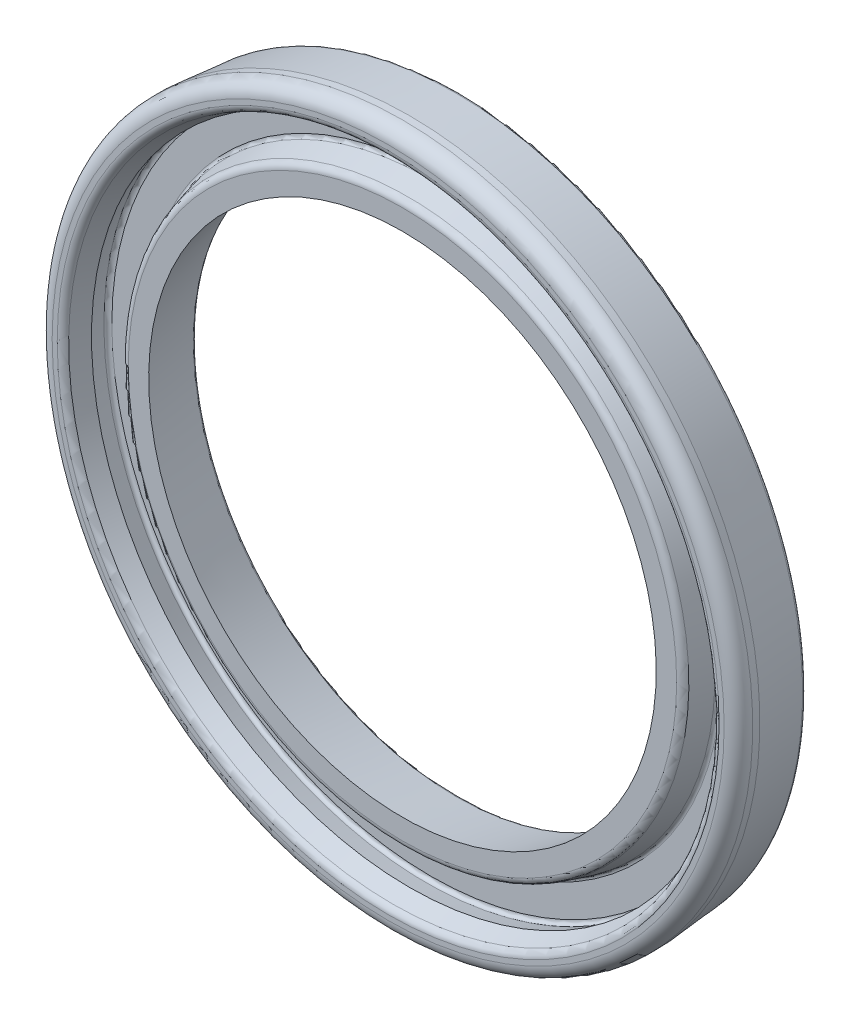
ISO-10303-21;
HEADER;
FILE_DESCRIPTION(('STEP AP214'),'2;1');
FILE_NAME('part.step','',(''),(''),'','','');
FILE_SCHEMA(('AUTOMOTIVE_DESIGN { 1 0 10303 214 1 1 1 1 }'));
ENDSEC;
DATA;
#1=APPLICATION_CONTEXT('core data for automotive mechanical design processes');
#2=APPLICATION_PROTOCOL_DEFINITION('international standard','automotive_design',2000,#1);
#3=PRODUCT_CONTEXT('',#1,'mechanical');
#4=PRODUCT('Part','Part','',(#3));
#5=PRODUCT_RELATED_PRODUCT_CATEGORY('part','',(#4));
#6=PRODUCT_DEFINITION_FORMATION('','',#4);
#7=PRODUCT_DEFINITION_CONTEXT('part definition',#1,'design');
#8=PRODUCT_DEFINITION('design','',#6,#7);
#9=PRODUCT_DEFINITION_SHAPE('','',#8);
#10=(LENGTH_UNIT() NAMED_UNIT(*) SI_UNIT(.MILLI.,.METRE.));
#11=(NAMED_UNIT(*) PLANE_ANGLE_UNIT() SI_UNIT($,.RADIAN.));
#12=(NAMED_UNIT(*) SI_UNIT($,.STERADIAN.) SOLID_ANGLE_UNIT());
#13=UNCERTAINTY_MEASURE_WITH_UNIT(LENGTH_MEASURE(1.E-05),#10,'distance_accuracy_value','');
#14=(GEOMETRIC_REPRESENTATION_CONTEXT(3) GLOBAL_UNCERTAINTY_ASSIGNED_CONTEXT((#13)) GLOBAL_UNIT_ASSIGNED_CONTEXT((#10,
#11,#12)) REPRESENTATION_CONTEXT('',''));
#15=CARTESIAN_POINT('',(0.,0.,0.));
#16=DIRECTION('',(0.,0.,1.));
#17=DIRECTION('',(1.,0.,0.));
#18=AXIS2_PLACEMENT_3D('',#15,#16,#17);
#19=CARTESIAN_POINT('',(0.,0.,4.62940949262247));
#20=DIRECTION('',(0.,0.,-1.));
#21=DIRECTION('',(0.,1.,0.));
#22=AXIS2_PLACEMENT_3D('',#19,#20,#21);
#23=CONICAL_SURFACE('',#22,45.1351977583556,0.261799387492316);
#24=CARTESIAN_POINT('',(0.,0.,4.62940949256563));
#25=DIRECTION('',(0.,0.,-1.));
#26=DIRECTION('',(1.38839100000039E-13,1.,0.));
#27=AXIS2_PLACEMENT_3D('',#24,#25,#26);
#28=CIRCLE('',#27,45.135197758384);
#29=CARTESIAN_POINT('',(6.2665302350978E-12,45.135197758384,4.62940949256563));
#30=VERTEX_POINT('',#29);
#31=EDGE_CURVE('E623',#30,#30,#28,.F.);
#32=ORIENTED_EDGE('',*,*,#31,.F.);
#33=EDGE_LOOP('',(#32));
#34=FACE_BOUND('',#33,.T.);
#35=CARTESIAN_POINT('',(0.,0.,7.00000001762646));
#36=DIRECTION('',(0.,0.,1.));
#37=DIRECTION('',(-7.29255799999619E-13,1.,0.));
#38=AXIS2_PLACEMENT_3D('',#35,#36,#37);
#39=CIRCLE('',#38,44.499999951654);
#40=CARTESIAN_POINT('',(-3.24518830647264E-11,44.499999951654,7.00000001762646));
#41=VERTEX_POINT('',#40);
#42=EDGE_CURVE('E128',#41,#41,#39,.T.);
#43=ORIENTED_EDGE('',*,*,#42,.T.);
#44=EDGE_LOOP('',(#43));
#45=FACE_BOUND('',#44,.T.);
#46=ADVANCED_FACE('F16',(#34,#45),#23,.F.);
#47=CARTESIAN_POINT('',(0.,0.,4.5));
#48=DIRECTION('',(0.,0.,1.));
#49=DIRECTION('',(1.973977E-13,-1.,0.));
#50=AXIS2_PLACEMENT_3D('',#47,#48,#49);
#51=TOROIDAL_SURFACE('',#50,44.65223489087,0.5);
#52=ORIENTED_EDGE('',*,*,#31,.T.);
#53=EDGE_LOOP('',(#52));
#54=FACE_BOUND('',#53,.T.);
#55=CARTESIAN_POINT('',(0.,0.,4.));
#56=DIRECTION('',(0.,0.,-1.));
#57=DIRECTION('',(1.,1.97558512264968E-13,0.));
#58=AXIS2_PLACEMENT_3D('',#55,#56,#57);
#59=CIRCLE('',#58,44.652234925);
#60=CARTESIAN_POINT('',(8.81073163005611E-12,-44.652234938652,4.00000000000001));
#61=VERTEX_POINT('',#60);
#62=CARTESIAN_POINT('',(44.652234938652,-3.92206797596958E-11,4.));
#63=VERTEX_POINT('',#62);
#64=EDGE_CURVE('E115',#61,#63,#59,.F.);
#65=ORIENTED_EDGE('',*,*,#64,.F.);
#66=CARTESIAN_POINT('',(0.,0.,4.));
#67=DIRECTION('',(0.,0.,-1.));
#68=DIRECTION('',(1.97152770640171E-13,-1.,0.));
#69=AXIS2_PLACEMENT_3D('',#66,#67,#68);
#70=CIRCLE('',#69,44.652234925);
#71=CARTESIAN_POINT('',(-44.652234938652,1.52175718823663E-11,4.));
#72=VERTEX_POINT('',#71);
#73=EDGE_CURVE('E118',#72,#61,#70,.F.);
#74=ORIENTED_EDGE('',*,*,#73,.F.);
#75=CARTESIAN_POINT('',(0.,0.,4.));
#76=DIRECTION('',(0.,0.,-1.));
#77=DIRECTION('',(-1.,-1.97214002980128E-13,0.));
#78=AXIS2_PLACEMENT_3D('',#75,#76,#77);
#79=CIRCLE('',#78,44.652234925);
#80=CARTESIAN_POINT('',(-8.80745063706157E-12,44.652234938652,4.));
#81=VERTEX_POINT('',#80);
#82=EDGE_CURVE('E126',#81,#72,#79,.F.);
#83=ORIENTED_EDGE('',*,*,#82,.F.);
#84=CARTESIAN_POINT('',(0.,0.,4.));
#85=DIRECTION('',(0.,0.,-1.));
#86=DIRECTION('',(-1.97275235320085E-13,1.,0.));
#87=AXIS2_PLACEMENT_3D('',#84,#85,#86);
#88=CIRCLE('',#87,44.652234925);
#89=EDGE_CURVE('E112',#63,#81,#88,.F.);
#90=ORIENTED_EDGE('',*,*,#89,.F.);
#91=EDGE_LOOP('',(#65,#74,#83,#90));
#92=FACE_BOUND('',#91,.T.);
#93=ADVANCED_FACE('F117',(#54,#92),#51,.F.);
#94=CARTESIAN_POINT('',(0.,0.,9.34202016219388));
#95=DIRECTION('',(0.,0.,1.));
#96=DIRECTION('',(0.,-1.,0.));
#97=AXIS2_PLACEMENT_3D('',#94,#95,#96);
#98=CONICAL_SURFACE('',#97,45.3524255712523,0.349065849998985);
#99=ORIENTED_EDGE('',*,*,#42,.F.);
#100=EDGE_LOOP('',(#99));
#101=FACE_BOUND('',#100,.T.);
#102=CARTESIAN_POINT('',(0.,0.,9.34202014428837));
#103=DIRECTION('',(0.,0.,1.));
#104=DIRECTION('',(1.973977E-13,-1.,0.));
#105=AXIS2_PLACEMENT_3D('',#102,#103,#104);
#106=CIRCLE('',#105,45.3524256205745);
#107=CARTESIAN_POINT('',(8.95246450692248E-12,-45.3524256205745,9.34202014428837));
#108=VERTEX_POINT('',#107);
#109=EDGE_CURVE('E206',#108,#108,#106,.F.);
#110=ORIENTED_EDGE('',*,*,#109,.F.);
#111=EDGE_LOOP('',(#110));
#112=FACE_BOUND('',#111,.T.);
#113=ADVANCED_FACE('F148',(#101,#112),#98,.F.);
#114=CARTESIAN_POINT('',(49.1174584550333,49.1174584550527,4.));
#115=DIRECTION('',(0.,0.,1.));
#116=DIRECTION('',(0.,-1.,0.));
#117=AXIS2_PLACEMENT_3D('',#114,#115,#116);
#118=PLANE('',#117);
#119=CARTESIAN_POINT('',(0.,0.,4.));
#120=DIRECTION('',(0.,0.,1.));
#121=DIRECTION('',(-1.,-1.97214002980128E-13,0.));
#122=AXIS2_PLACEMENT_3D('',#119,#120,#121);
#123=CIRCLE('',#122,40.58366348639);
#124=CARTESIAN_POINT('',(8.00966652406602E-12,-40.58366348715,4.));
#125=VERTEX_POINT('',#124);
#126=CARTESIAN_POINT('',(-40.58366348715,-8.00535096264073E-12,4.));
#127=VERTEX_POINT('',#126);
#128=EDGE_CURVE('E694',#125,#127,#123,.F.);
#129=ORIENTED_EDGE('',*,*,#128,.T.);
#130=CARTESIAN_POINT('',(0.,0.,4.));
#131=DIRECTION('',(0.,0.,1.));
#132=DIRECTION('',(-1.97275235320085E-13,1.,0.));
#133=AXIS2_PLACEMENT_3D('',#130,#131,#132);
#134=CIRCLE('',#133,40.58366348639);
#135=CARTESIAN_POINT('',(-8.00668448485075E-12,40.58366348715,4.));
#136=VERTEX_POINT('',#135);
#137=EDGE_CURVE('E189',#127,#136,#134,.F.);
#138=ORIENTED_EDGE('',*,*,#137,.T.);
#139=CARTESIAN_POINT('',(0.,0.,4.));
#140=DIRECTION('',(0.,0.,1.));
#141=DIRECTION('',(1.,1.97336467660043E-13,0.));
#142=AXIS2_PLACEMENT_3D('',#139,#140,#141);
#143=CIRCLE('',#142,40.58366348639);
#144=CARTESIAN_POINT('',(40.58366348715,8.00921850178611E-12,4.));
#145=VERTEX_POINT('',#144);
#146=EDGE_CURVE('E202',#136,#145,#143,.F.);
#147=ORIENTED_EDGE('',*,*,#146,.T.);
#148=CARTESIAN_POINT('',(0.,0.,4.));
#149=DIRECTION('',(0.,0.,1.));
#150=DIRECTION('',(1.973977E-13,-1.,0.));
#151=AXIS2_PLACEMENT_3D('',#148,#149,#150);
#152=CIRCLE('',#151,40.58366348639);
#153=EDGE_CURVE('E704',#145,#125,#152,.F.);
#154=ORIENTED_EDGE('',*,*,#153,.T.);
#155=EDGE_LOOP('',(#129,#138,#147,#154));
#156=FACE_BOUND('',#155,.T.);
#157=ORIENTED_EDGE('',*,*,#89,.T.);
#158=ORIENTED_EDGE('',*,*,#82,.T.);
#159=ORIENTED_EDGE('',*,*,#73,.T.);
#160=ORIENTED_EDGE('',*,*,#64,.T.);
#161=EDGE_LOOP('',(#157,#158,#159,#160));
#162=FACE_BOUND('',#161,.T.);
#163=ADVANCED_FACE('F125',(#156,#162),#118,.T.);
#164=CARTESIAN_POINT('',(0.,0.,9.));
#165=DIRECTION('',(0.,0.,1.));
#166=DIRECTION('',(1.973977E-13,-1.,0.));
#167=AXIS2_PLACEMENT_3D('',#164,#165,#166);
#168=TOROIDAL_SURFACE('',#167,46.29211824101,1.);
#169=CARTESIAN_POINT('',(0.,0.,10.));
#170=DIRECTION('',(0.,0.,1.));
#171=DIRECTION('',(1.,1.97558512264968E-13,0.));
#172=AXIS2_PLACEMENT_3D('',#169,#170,#171);
#173=CIRCLE('',#172,46.292118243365);
#174=CARTESIAN_POINT('',(46.292118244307,9.14812191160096E-12,10.));
#175=VERTEX_POINT('',#174);
#176=CARTESIAN_POINT('',(-9.13200686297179E-12,46.292118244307,10.));
#177=VERTEX_POINT('',#176);
#178=EDGE_CURVE('E240',#175,#177,#173,.T.);
#179=ORIENTED_EDGE('',*,*,#178,.T.);
#180=CARTESIAN_POINT('',(0.,0.,10.));
#181=DIRECTION('',(0.,0.,1.));
#182=DIRECTION('',(-1.97275235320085E-13,1.,0.));
#183=AXIS2_PLACEMENT_3D('',#180,#181,#182);
#184=CIRCLE('',#183,46.292118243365);
#185=CARTESIAN_POINT('',(-46.292118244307,-9.13358514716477E-12,10.));
#186=VERTEX_POINT('',#185);
#187=EDGE_CURVE('E250',#177,#186,#184,.T.);
#188=ORIENTED_EDGE('',*,*,#187,.T.);
#189=CARTESIAN_POINT('',(0.,0.,10.));
#190=DIRECTION('',(0.,0.,1.));
#191=DIRECTION('',(-1.,-1.97214002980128E-13,0.));
#192=AXIS2_PLACEMENT_3D('',#189,#190,#191);
#193=CIRCLE('',#192,46.292118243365);
#194=CARTESIAN_POINT('',(9.13540835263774E-12,-46.292118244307,10.));
#195=VERTEX_POINT('',#194);
#196=EDGE_CURVE('E244',#186,#195,#193,.T.);
#197=ORIENTED_EDGE('',*,*,#196,.T.);
#198=CARTESIAN_POINT('',(0.,0.,10.));
#199=DIRECTION('',(0.,0.,1.));
#200=DIRECTION('',(1.973977E-13,-1.,0.));
#201=AXIS2_PLACEMENT_3D('',#198,#199,#200);
#202=CIRCLE('',#201,46.292118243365);
#203=EDGE_CURVE('E234',#195,#175,#202,.T.);
#204=ORIENTED_EDGE('',*,*,#203,.T.);
#205=EDGE_LOOP('',(#179,#188,#197,#204));
#206=FACE_BOUND('',#205,.T.);
#207=ORIENTED_EDGE('',*,*,#109,.T.);
#208=EDGE_LOOP('',(#207));
#209=FACE_BOUND('',#208,.T.);
#210=ADVANCED_FACE('F147',(#206,#209),#168,.T.);
#211=CARTESIAN_POINT('',(0.,0.,4.5));
#212=DIRECTION('',(0.,0.,1.));
#213=DIRECTION('',(1.973977E-13,-1.,0.));
#214=AXIS2_PLACEMENT_3D('',#211,#212,#213);
#215=TOROIDAL_SURFACE('',#214,40.58366349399,0.5);
#216=CARTESIAN_POINT('',(0.,0.,4.37059046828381));
#217=DIRECTION('',(0.,0.,-1.));
#218=DIRECTION('',(1.97397699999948E-13,-1.,0.));
#219=AXIS2_PLACEMENT_3D('',#216,#217,#218);
#220=CIRCLE('',#219,40.1007005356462);
#221=CARTESIAN_POINT('',(7.91578605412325E-12,-40.1007005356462,4.37059046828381));
#222=VERTEX_POINT('',#221);
#223=EDGE_CURVE('E231',#222,#222,#220,.F.);
#224=ORIENTED_EDGE('',*,*,#223,.F.);
#225=EDGE_LOOP('',(#224));
#226=FACE_BOUND('',#225,.T.);
#227=ORIENTED_EDGE('',*,*,#137,.F.);
#228=ORIENTED_EDGE('',*,*,#128,.F.);
#229=ORIENTED_EDGE('',*,*,#153,.F.);
#230=ORIENTED_EDGE('',*,*,#146,.F.);
#231=EDGE_LOOP('',(#227,#228,#229,#230));
#232=FACE_BOUND('',#231,.T.);
#233=ADVANCED_FACE('F208',(#226,#232),#215,.F.);
#234=CARTESIAN_POINT('',(-51.6999994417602,51.6999994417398,10.));
#235=DIRECTION('',(0.,0.,-1.));
#236=DIRECTION('',(0.,1.,0.));
#237=AXIS2_PLACEMENT_3D('',#234,#235,#236);
#238=PLANE('',#237);
#239=ORIENTED_EDGE('',*,*,#196,.F.);
#240=ORIENTED_EDGE('',*,*,#187,.F.);
#241=ORIENTED_EDGE('',*,*,#178,.F.);
#242=ORIENTED_EDGE('',*,*,#203,.F.);
#243=EDGE_LOOP('',(#239,#240,#241,#242));
#244=FACE_BOUND('',#243,.T.);
#245=CARTESIAN_POINT('',(0.,0.,9.99999999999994));
#246=DIRECTION('',(0.,0.,-1.));
#247=DIRECTION('',(-1.,-1.97581397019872E-13,0.));
#248=AXIS2_PLACEMENT_3D('',#245,#246,#247);
#249=CIRCLE('',#248,46.9999994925);
#250=CARTESIAN_POINT('',(-46.99999954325,-9.27913984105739E-12,9.99999999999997));
#251=VERTEX_POINT('',#250);
#252=CARTESIAN_POINT('',(-9.28031110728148E-12,46.99999954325,9.99999999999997));
#253=VERTEX_POINT('',#252);
#254=EDGE_CURVE('E233',#251,#253,#249,.T.);
#255=ORIENTED_EDGE('',*,*,#254,.F.);
#256=CARTESIAN_POINT('',(0.,0.,9.99999999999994));
#257=DIRECTION('',(0.,0.,-1.));
#258=DIRECTION('',(1.97520164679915E-13,-1.,0.));
#259=AXIS2_PLACEMENT_3D('',#256,#257,#258);
#260=CIRCLE('',#259,46.9999994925);
#261=CARTESIAN_POINT('',(9.283764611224E-12,-46.99999954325,9.99999999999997));
#262=VERTEX_POINT('',#261);
#263=EDGE_CURVE('E292',#262,#251,#260,.T.);
#264=ORIENTED_EDGE('',*,*,#263,.F.);
#265=CARTESIAN_POINT('',(0.,0.,9.99999999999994));
#266=DIRECTION('',(0.,0.,-1.));
#267=DIRECTION('',(1.,1.97014843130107E-13,0.));
#268=AXIS2_PLACEMENT_3D('',#265,#266,#267);
#269=CIRCLE('',#268,46.9999994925);
#270=CARTESIAN_POINT('',(46.99999954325,9.26018136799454E-12,9.99999999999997));
#271=VERTEX_POINT('',#270);
#272=EDGE_CURVE('E298',#271,#262,#269,.T.);
#273=ORIENTED_EDGE('',*,*,#272,.F.);
#274=CARTESIAN_POINT('',(0.,0.,9.99999999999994));
#275=DIRECTION('',(0.,0.,-1.));
#276=DIRECTION('',(-1.973977E-13,1.,0.));
#277=AXIS2_PLACEMENT_3D('',#274,#275,#276);
#278=CIRCLE('',#277,46.9999994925);
#279=EDGE_CURVE('E305',#253,#271,#278,.T.);
#280=ORIENTED_EDGE('',*,*,#279,.F.);
#281=EDGE_LOOP('',(#255,#264,#273,#280));
#282=FACE_BOUND('',#281,.T.);
#283=ADVANCED_FACE('F218',(#244,#282),#238,.F.);
#284=CARTESIAN_POINT('',(0.,0.,4.37059046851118));
#285=DIRECTION('',(0.,0.,-1.));
#286=DIRECTION('',(0.,1.,0.));
#287=AXIS2_PLACEMENT_3D('',#284,#285,#286);
#288=CONICAL_SURFACE('',#287,40.1007005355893,0.26179938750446);
#289=ORIENTED_EDGE('',*,*,#223,.T.);
#290=EDGE_LOOP('',(#289));
#291=FACE_BOUND('',#290,.T.);
#292=CARTESIAN_POINT('',(0.,0.,7.25881916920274));
#293=DIRECTION('',(0.,0.,1.));
#294=DIRECTION('',(1.973977E-13,-1.,0.));
#295=AXIS2_PLACEMENT_3D('',#292,#293,#294);
#296=CIRCLE('',#295,39.3268020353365);
#297=CARTESIAN_POINT('',(7.76302027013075E-12,-39.3268020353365,7.25881916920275));
#298=VERTEX_POINT('',#297);
#299=EDGE_CURVE('E301',#298,#298,#296,.T.);
#300=ORIENTED_EDGE('',*,*,#299,.F.);
#301=EDGE_LOOP('',(#300));
#302=FACE_BOUND('',#301,.T.);
#303=ADVANCED_FACE('F348',(#291,#302),#288,.T.);
#304=CARTESIAN_POINT('',(0.,0.,8.));
#305=DIRECTION('',(0.,0.,-1.));
#306=DIRECTION('',(-1.973977E-13,1.,0.));
#307=AXIS2_PLACEMENT_3D('',#304,#305,#306);
#308=TOROIDAL_SURFACE('',#307,47.,2.);
#309=ORIENTED_EDGE('',*,*,#254,.T.);
#310=ORIENTED_EDGE('',*,*,#279,.T.);
#311=ORIENTED_EDGE('',*,*,#272,.T.);
#312=ORIENTED_EDGE('',*,*,#263,.T.);
#313=EDGE_LOOP('',(#309,#310,#311,#312));
#314=FACE_BOUND('',#313,.T.);
#315=CARTESIAN_POINT('',(0.,0.,8.));
#316=DIRECTION('',(0.,0.,1.));
#317=DIRECTION('',(0.,-1.,0.));
#318=AXIS2_PLACEMENT_3D('',#315,#316,#317);
#319=CIRCLE('',#318,49.);
#320=CARTESIAN_POINT('',(0.,-49.,8.));
#321=VERTEX_POINT('',#320);
#322=EDGE_CURVE('E303',#321,#321,#319,.F.);
#323=ORIENTED_EDGE('',*,*,#322,.F.);
#324=EDGE_LOOP('',(#323));
#325=FACE_BOUND('',#324,.T.);
#326=ADVANCED_FACE('F293',(#314,#325),#308,.T.);
#327=CARTESIAN_POINT('',(0.,0.,7.));
#328=DIRECTION('',(0.,0.,1.));
#329=DIRECTION('',(1.973977E-13,-1.,0.));
#330=AXIS2_PLACEMENT_3D('',#327,#328,#329);
#331=TOROIDAL_SURFACE('',#330,38.3608762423,1.);
#332=ORIENTED_EDGE('',*,*,#299,.T.);
#333=EDGE_LOOP('',(#332));
#334=FACE_BOUND('',#333,.T.);
#335=CARTESIAN_POINT('',(0.,0.,7.99999999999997));
#336=DIRECTION('',(0.,0.,-1.));
#337=DIRECTION('',(-1.97275235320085E-13,1.,0.));
#338=AXIS2_PLACEMENT_3D('',#335,#336,#337);
#339=CIRCLE('',#338,38.360876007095);
#340=CARTESIAN_POINT('',(38.360875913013,7.56839514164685E-12,7.99999999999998));
#341=VERTEX_POINT('',#340);
#342=CARTESIAN_POINT('',(-7.56872380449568E-12,38.360875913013,7.99999999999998));
#343=VERTEX_POINT('',#342);
#344=EDGE_CURVE('E490',#341,#343,#339,.F.);
#345=ORIENTED_EDGE('',*,*,#344,.F.);
#346=CARTESIAN_POINT('',(0.,0.,7.99999999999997));
#347=DIRECTION('',(0.,0.,-1.));
#348=DIRECTION('',(1.,1.97336467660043E-13,0.));
#349=AXIS2_PLACEMENT_3D('',#346,#347,#348);
#350=CIRCLE('',#349,38.360876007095);
#351=CARTESIAN_POINT('',(7.57154251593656E-12,-38.360875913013,7.99999999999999));
#352=VERTEX_POINT('',#351);
#353=EDGE_CURVE('E404',#352,#341,#350,.F.);
#354=ORIENTED_EDGE('',*,*,#353,.F.);
#355=CARTESIAN_POINT('',(0.,0.,7.99999999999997));
#356=DIRECTION('',(0.,0.,-1.));
#357=DIRECTION('',(1.97152770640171E-13,-1.,0.));
#358=AXIS2_PLACEMENT_3D('',#355,#356,#357);
#359=CIRCLE('',#358,38.360876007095);
#360=CARTESIAN_POINT('',(-38.360875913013,-7.57281074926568E-12,7.99999999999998));
#361=VERTEX_POINT('',#360);
#362=EDGE_CURVE('E382',#361,#352,#359,.F.);
#363=ORIENTED_EDGE('',*,*,#362,.F.);
#364=CARTESIAN_POINT('',(0.,0.,7.99999999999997));
#365=DIRECTION('',(0.,0.,-1.));
#366=DIRECTION('',(-1.,-1.97214002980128E-13,0.));
#367=AXIS2_PLACEMENT_3D('',#364,#365,#366);
#368=CIRCLE('',#367,38.360876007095);
#369=EDGE_CURVE('E338',#343,#361,#368,.F.);
#370=ORIENTED_EDGE('',*,*,#369,.F.);
#371=EDGE_LOOP('',(#345,#354,#363,#370));
#372=FACE_BOUND('',#371,.T.);
#373=ADVANCED_FACE('F347',(#334,#372),#331,.T.);
#374=CARTESIAN_POINT('',(0.,0.,10.5));
#375=DIRECTION('',(0.,0.,1.));
#376=DIRECTION('',(0.,-1.,0.));
#377=AXIS2_PLACEMENT_3D('',#374,#375,#376);
#378=CYLINDRICAL_SURFACE('',#377,49.);
#379=CARTESIAN_POINT('',(0.,0.,7.00000000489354));
#380=DIRECTION('',(0.,0.,1.));
#381=DIRECTION('',(-7.17265399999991E-13,1.,0.));
#382=AXIS2_PLACEMENT_3D('',#379,#380,#381);
#383=CIRCLE('',#382,48.9999999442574);
#384=CARTESIAN_POINT('',(-3.51460045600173E-11,48.9999999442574,7.00000000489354));
#385=VERTEX_POINT('',#384);
#386=EDGE_CURVE('E494',#385,#385,#383,.F.);
#387=ORIENTED_EDGE('',*,*,#386,.F.);
#388=EDGE_LOOP('',(#387));
#389=FACE_BOUND('',#388,.T.);
#390=ORIENTED_EDGE('',*,*,#322,.T.);
#391=EDGE_LOOP('',(#390));
#392=FACE_BOUND('',#391,.T.);
#393=ADVANCED_FACE('F472',(#389,#392),#378,.T.);
#394=CARTESIAN_POINT('',(42.1969633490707,42.1969633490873,8.));
#395=DIRECTION('',(0.,0.,1.));
#396=DIRECTION('',(0.,-1.,0.));
#397=AXIS2_PLACEMENT_3D('',#394,#395,#396);
#398=PLANE('',#397);
#399=CARTESIAN_POINT('',(0.,0.,7.99999999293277));
#400=DIRECTION('',(0.,0.,-1.));
#401=DIRECTION('',(0.,1.,0.));
#402=AXIS2_PLACEMENT_3D('',#399,#400,#401);
#403=CIRCLE('',#402,35.4999999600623);
#404=CARTESIAN_POINT('',(0.,35.4999999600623,7.99999999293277));
#405=VERTEX_POINT('',#404);
#406=EDGE_CURVE('E455',#405,#405,#403,.T.);
#407=ORIENTED_EDGE('',*,*,#406,.T.);
#408=EDGE_LOOP('',(#407));
#409=FACE_BOUND('',#408,.T.);
#410=ORIENTED_EDGE('',*,*,#353,.T.);
#411=ORIENTED_EDGE('',*,*,#344,.T.);
#412=ORIENTED_EDGE('',*,*,#369,.T.);
#413=ORIENTED_EDGE('',*,*,#362,.T.);
#414=EDGE_LOOP('',(#410,#411,#412,#413));
#415=FACE_BOUND('',#414,.T.);
#416=ADVANCED_FACE('F463',(#409,#415),#398,.T.);
#417=CARTESIAN_POINT('',(0.,0.,7.0000000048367));
#418=DIRECTION('',(0.,0.,1.));
#419=DIRECTION('',(0.,-1.,0.));
#420=AXIS2_PLACEMENT_3D('',#417,#418,#419);
#421=CONICAL_SURFACE('',#420,48.9999999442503,0.0872664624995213);
#422=ORIENTED_EDGE('',*,*,#386,.T.);
#423=EDGE_LOOP('',(#422));
#424=FACE_BOUND('',#423,.T.);
#425=CARTESIAN_POINT('',(0.,0.,0.456422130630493));
#426=DIRECTION('',(0.,0.,1.));
#427=DIRECTION('',(1.973977E-13,-1.,0.));
#428=AXIS2_PLACEMENT_3D('',#425,#426,#427);
#429=CIRCLE('',#428,48.4275111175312);
#430=CARTESIAN_POINT('',(9.55947931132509E-12,-48.4275111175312,0.456422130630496));
#431=VERTEX_POINT('',#430);
#432=EDGE_CURVE('E452',#431,#431,#429,.F.);
#433=ORIENTED_EDGE('',*,*,#432,.F.);
#434=EDGE_LOOP('',(#433));
#435=FACE_BOUND('',#434,.T.);
#436=ADVANCED_FACE('F471',(#424,#435),#421,.T.);
#437=CARTESIAN_POINT('',(0.,0.,0.413175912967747));
#438=DIRECTION('',(0.,0.,-1.));
#439=DIRECTION('',(0.,1.,0.));
#440=AXIS2_PLACEMENT_3D('',#437,#438,#439);
#441=CONICAL_SURFACE('',#440,36.8377617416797,0.174532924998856);
#442=CARTESIAN_POINT('',(0.,0.,0.413175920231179));
#443=DIRECTION('',(0.,0.,1.));
#444=DIRECTION('',(1.973977E-13,-1.,0.));
#445=AXIS2_PLACEMENT_3D('',#442,#443,#444);
#446=CIRCLE('',#445,36.8377617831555);
#447=CARTESIAN_POINT('',(7.27168944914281E-12,-36.8377617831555,0.413175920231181));
#448=VERTEX_POINT('',#447);
#449=EDGE_CURVE('E443',#448,#448,#446,.T.);
#450=ORIENTED_EDGE('',*,*,#449,.F.);
#451=EDGE_LOOP('',(#450));
#452=FACE_BOUND('',#451,.T.);
#453=ORIENTED_EDGE('',*,*,#406,.F.);
#454=EDGE_LOOP('',(#453));
#455=FACE_BOUND('',#454,.T.);
#456=ADVANCED_FACE('F422',(#452,#455),#441,.F.);
#457=CARTESIAN_POINT('',(0.,0.,0.5));
#458=DIRECTION('',(0.,0.,1.));
#459=DIRECTION('',(1.973977E-13,-1.,0.));
#460=AXIS2_PLACEMENT_3D('',#457,#458,#459);
#461=TOROIDAL_SURFACE('',#460,47.92941376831,0.5);
#462=ORIENTED_EDGE('',*,*,#432,.T.);
#463=EDGE_LOOP('',(#462));
#464=FACE_BOUND('',#463,.T.);
#465=CARTESIAN_POINT('',(0.,0.,0.));
#466=DIRECTION('',(0.,0.,1.));
#467=DIRECTION('',(1.,1.97336467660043E-13,0.));
#468=AXIS2_PLACEMENT_3D('',#465,#466,#467);
#469=CIRCLE('',#468,47.929413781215);
#470=CARTESIAN_POINT('',(-9.45625678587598E-12,47.929413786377,0.));
#471=VERTEX_POINT('',#470);
#472=CARTESIAN_POINT('',(47.929413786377,9.46825900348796E-12,0.));
#473=VERTEX_POINT('',#472);
#474=EDGE_CURVE('E621',#471,#473,#469,.F.);
#475=ORIENTED_EDGE('',*,*,#474,.F.);
#476=CARTESIAN_POINT('',(0.,0.,0.));
#477=DIRECTION('',(0.,0.,1.));
#478=DIRECTION('',(-1.97275235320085E-13,1.,0.));
#479=AXIS2_PLACEMENT_3D('',#476,#477,#478);
#480=CIRCLE('',#479,47.929413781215);
#481=CARTESIAN_POINT('',(-47.929413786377,-9.4607932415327E-12,0.));
#482=VERTEX_POINT('',#481);
#483=EDGE_CURVE('E451',#482,#471,#480,.F.);
#484=ORIENTED_EDGE('',*,*,#483,.F.);
#485=CARTESIAN_POINT('',(0.,0.,0.));
#486=DIRECTION('',(0.,0.,1.));
#487=DIRECTION('',(-1.,-1.97214002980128E-13,0.));
#488=AXIS2_PLACEMENT_3D('',#485,#486,#487);
#489=CIRCLE('',#488,47.929413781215);
#490=CARTESIAN_POINT('',(9.45977858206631E-12,-47.929413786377,0.));
#491=VERTEX_POINT('',#490);
#492=EDGE_CURVE('E438',#491,#482,#489,.F.);
#493=ORIENTED_EDGE('',*,*,#492,.F.);
#494=CARTESIAN_POINT('',(0.,0.,0.));
#495=DIRECTION('',(0.,0.,1.));
#496=DIRECTION('',(1.973977E-13,-1.,0.));
#497=AXIS2_PLACEMENT_3D('',#494,#495,#496);
#498=CIRCLE('',#497,47.929413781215);
#499=EDGE_CURVE('E612',#473,#491,#498,.F.);
#500=ORIENTED_EDGE('',*,*,#499,.F.);
#501=EDGE_LOOP('',(#475,#484,#493,#500));
#502=FACE_BOUND('',#501,.T.);
#503=ADVANCED_FACE('F410',(#464,#502),#461,.T.);
#504=CARTESIAN_POINT('',(0.,0.,0.5));
#505=DIRECTION('',(0.,0.,1.));
#506=DIRECTION('',(1.973977E-13,-1.,0.));
#507=AXIS2_PLACEMENT_3D('',#504,#505,#506);
#508=TOROIDAL_SURFACE('',#507,37.33016566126,0.5);
#509=ORIENTED_EDGE('',*,*,#449,.T.);
#510=EDGE_LOOP('',(#509));
#511=FACE_BOUND('',#510,.T.);
#512=CARTESIAN_POINT('',(0.,0.,0.));
#513=DIRECTION('',(0.,0.,-1.));
#514=DIRECTION('',(-1.,-1.97214002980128E-13,0.));
#515=AXIS2_PLACEMENT_3D('',#512,#513,#514);
#516=CIRCLE('',#515,37.330165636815);
#517=CARTESIAN_POINT('',(-7.36345689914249E-12,37.330165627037,0.));
#518=VERTEX_POINT('',#517);
#519=CARTESIAN_POINT('',(-37.330165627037,-7.36482838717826E-12,0.));
#520=VERTEX_POINT('',#519);
#521=EDGE_CURVE('E572',#518,#520,#516,.F.);
#522=ORIENTED_EDGE('',*,*,#521,.F.);
#523=CARTESIAN_POINT('',(0.,0.,0.));
#524=DIRECTION('',(0.,0.,-1.));
#525=DIRECTION('',(-1.97275235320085E-13,1.,0.));
#526=AXIS2_PLACEMENT_3D('',#523,#524,#525);
#527=CIRCLE('',#526,37.330165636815);
#528=CARTESIAN_POINT('',(37.330165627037,7.36574271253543E-12,0.));
#529=VERTEX_POINT('',#528);
#530=EDGE_CURVE('E570',#529,#518,#527,.F.);
#531=ORIENTED_EDGE('',*,*,#530,.F.);
#532=CARTESIAN_POINT('',(0.,0.,0.));
#533=DIRECTION('',(0.,0.,-1.));
#534=DIRECTION('',(1.,1.97336467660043E-13,0.));
#535=AXIS2_PLACEMENT_3D('',#532,#533,#534);
#536=CIRCLE('',#535,37.330165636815);
#537=CARTESIAN_POINT('',(7.36619987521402E-12,-37.330165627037,0.));
#538=VERTEX_POINT('',#537);
#539=EDGE_CURVE('E10',#538,#529,#536,.F.);
#540=ORIENTED_EDGE('',*,*,#539,.F.);
#541=CARTESIAN_POINT('',(0.,0.,0.));
#542=DIRECTION('',(0.,0.,-1.));
#543=DIRECTION('',(1.97152770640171E-13,-1.,0.));
#544=AXIS2_PLACEMENT_3D('',#541,#542,#543);
#545=CIRCLE('',#544,37.330165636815);
#546=EDGE_CURVE('E26',#520,#538,#545,.F.);
#547=ORIENTED_EDGE('',*,*,#546,.F.);
#548=EDGE_LOOP('',(#522,#531,#540,#547));
#549=FACE_BOUND('',#548,.T.);
#550=ADVANCED_FACE('F421',(#511,#549),#508,.T.);
#551=CARTESIAN_POINT('',(-52.7223551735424,52.7223551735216,0.));
#552=DIRECTION('',(0.,0.,-1.));
#553=DIRECTION('',(0.,1.,0.));
#554=AXIS2_PLACEMENT_3D('',#551,#552,#553);
#555=PLANE('',#554);
#556=ORIENTED_EDGE('',*,*,#546,.T.);
#557=ORIENTED_EDGE('',*,*,#539,.T.);
#558=ORIENTED_EDGE('',*,*,#530,.T.);
#559=ORIENTED_EDGE('',*,*,#521,.T.);
#560=EDGE_LOOP('',(#556,#557,#558,#559));
#561=FACE_BOUND('',#560,.T.);
#562=ORIENTED_EDGE('',*,*,#499,.T.);
#563=ORIENTED_EDGE('',*,*,#492,.T.);
#564=ORIENTED_EDGE('',*,*,#483,.T.);
#565=ORIENTED_EDGE('',*,*,#474,.T.);
#566=EDGE_LOOP('',(#562,#563,#564,#565));
#567=FACE_BOUND('',#566,.T.);
#568=ADVANCED_FACE('F509',(#561,#567),#555,.T.);
#569=CLOSED_SHELL('',(#46,#93,#113,#163,#210,#233,#283,#303,#326,#373,#393,#416,#436,#456,#503,
#550,#568));
#570=MANIFOLD_SOLID_BREP('B1',#569);
#571=ADVANCED_BREP_SHAPE_REPRESENTATION('',(#18,#570),#14);
#572=SHAPE_DEFINITION_REPRESENTATION(#9,#571);
ENDSEC;
END-ISO-10303-21;
